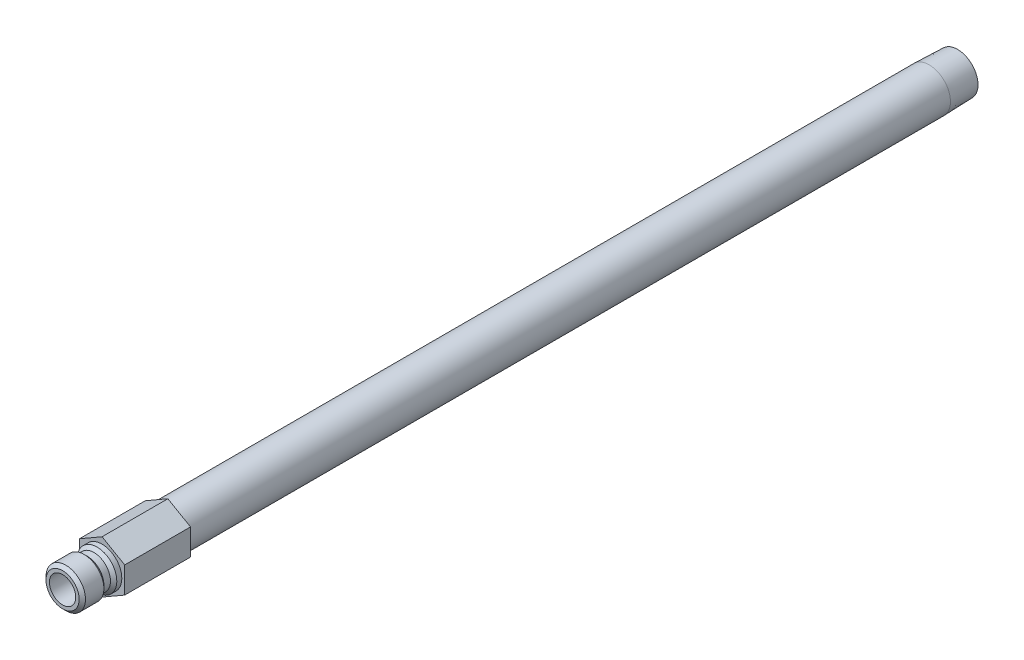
ISO-10303-21;
HEADER;
FILE_DESCRIPTION(('STEP AP214'),'2;1');
FILE_NAME('part.step','',(''),(''),'','','');
FILE_SCHEMA(('AUTOMOTIVE_DESIGN { 1 0 10303 214 1 1 1 1 }'));
ENDSEC;
DATA;
#1=APPLICATION_CONTEXT('core data for automotive mechanical design processes');
#2=APPLICATION_PROTOCOL_DEFINITION('international standard','automotive_design',2000,#1);
#3=PRODUCT_CONTEXT('',#1,'mechanical');
#4=PRODUCT('Part','Part','',(#3));
#5=PRODUCT_RELATED_PRODUCT_CATEGORY('part','',(#4));
#6=PRODUCT_DEFINITION_FORMATION('','',#4);
#7=PRODUCT_DEFINITION_CONTEXT('part definition',#1,'design');
#8=PRODUCT_DEFINITION('design','',#6,#7);
#9=PRODUCT_DEFINITION_SHAPE('','',#8);
#10=(LENGTH_UNIT() NAMED_UNIT(*) SI_UNIT(.MILLI.,.METRE.));
#11=(NAMED_UNIT(*) PLANE_ANGLE_UNIT() SI_UNIT($,.RADIAN.));
#12=(NAMED_UNIT(*) SI_UNIT($,.STERADIAN.) SOLID_ANGLE_UNIT());
#13=UNCERTAINTY_MEASURE_WITH_UNIT(LENGTH_MEASURE(1.E-05),#10,'distance_accuracy_value','');
#14=(GEOMETRIC_REPRESENTATION_CONTEXT(3) GLOBAL_UNCERTAINTY_ASSIGNED_CONTEXT((#13)) GLOBAL_UNIT_ASSIGNED_CONTEXT((#10,
#11,#12)) REPRESENTATION_CONTEXT('',''));
#15=CARTESIAN_POINT('',(0.,0.,0.));
#16=DIRECTION('',(0.,0.,1.));
#17=DIRECTION('',(1.,0.,0.));
#18=AXIS2_PLACEMENT_3D('',#15,#16,#17);
#19=CARTESIAN_POINT('',(0.,4.7625,0.));
#20=DIRECTION('',(0.,0.,1.));
#21=DIRECTION('',(0.,-1.,0.));
#22=AXIS2_PLACEMENT_3D('',#19,#20,#21);
#23=PLANE('',#22);
#24=CARTESIAN_POINT('',(0.,0.,0.));
#25=DIRECTION('',(0.,0.,-1.));
#26=DIRECTION('',(0.,1.,0.));
#27=AXIS2_PLACEMENT_3D('',#24,#25,#26);
#28=CIRCLE('',#27,4.7625);
#29=CARTESIAN_POINT('',(0.,4.7625,0.));
#30=VERTEX_POINT('',#29);
#31=EDGE_CURVE('E165',#30,#30,#28,.T.);
#32=ORIENTED_EDGE('',*,*,#31,.T.);
#33=EDGE_LOOP('',(#32));
#34=FACE_BOUND('',#33,.T.);
#35=DIRECTION('',(-0.866025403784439,-0.5,0.));
#36=VECTOR('',#35,1.);
#37=CARTESIAN_POINT('',(0.,6.3058196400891,0.));
#38=LINE('',#37,#36);
#39=CARTESIAN_POINT('',(0.,6.3058196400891,0.));
#40=VERTEX_POINT('',#39);
#41=CARTESIAN_POINT('',(-5.461,3.15290982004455,0.));
#42=VERTEX_POINT('',#41);
#43=EDGE_CURVE('E121',#40,#42,#38,.T.);
#44=ORIENTED_EDGE('',*,*,#43,.T.);
#45=DIRECTION('',(0.,-1.,0.));
#46=VECTOR('',#45,1.);
#47=CARTESIAN_POINT('',(-5.461,3.15290982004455,0.));
#48=LINE('',#47,#46);
#49=CARTESIAN_POINT('',(-5.461,-3.15290982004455,0.));
#50=VERTEX_POINT('',#49);
#51=EDGE_CURVE('E124',#42,#50,#48,.T.);
#52=ORIENTED_EDGE('',*,*,#51,.T.);
#53=DIRECTION('',(0.866025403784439,-0.5,0.));
#54=VECTOR('',#53,1.);
#55=CARTESIAN_POINT('',(-5.461,-3.15290982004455,0.));
#56=LINE('',#55,#54);
#57=CARTESIAN_POINT('',(0.,-6.30581964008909,0.));
#58=VERTEX_POINT('',#57);
#59=EDGE_CURVE('E128',#50,#58,#56,.T.);
#60=ORIENTED_EDGE('',*,*,#59,.T.);
#61=DIRECTION('',(0.866025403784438,0.5,0.));
#62=VECTOR('',#61,1.);
#63=CARTESIAN_POINT('',(0.,-6.30581964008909,0.));
#64=LINE('',#63,#62);
#65=CARTESIAN_POINT('',(5.461,-3.15290982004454,0.));
#66=VERTEX_POINT('',#65);
#67=EDGE_CURVE('E131',#58,#66,#64,.T.);
#68=ORIENTED_EDGE('',*,*,#67,.T.);
#69=DIRECTION('',(0.,1.,0.));
#70=VECTOR('',#69,1.);
#71=CARTESIAN_POINT('',(5.461,-3.15290982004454,0.));
#72=LINE('',#71,#70);
#73=CARTESIAN_POINT('',(5.461,3.15290982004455,0.));
#74=VERTEX_POINT('',#73);
#75=EDGE_CURVE('E98',#66,#74,#72,.T.);
#76=ORIENTED_EDGE('',*,*,#75,.T.);
#77=DIRECTION('',(-0.866025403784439,0.5,0.));
#78=VECTOR('',#77,1.);
#79=CARTESIAN_POINT('',(5.461,3.15290982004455,0.));
#80=LINE('',#79,#78);
#81=EDGE_CURVE('E134',#74,#40,#80,.T.);
#82=ORIENTED_EDGE('',*,*,#81,.T.);
#83=EDGE_LOOP('',(#44,#52,#60,#68,#76,#82));
#84=FACE_BOUND('',#83,.T.);
#85=ADVANCED_FACE('F32',(#34,#84),#23,.T.);
#86=CARTESIAN_POINT('',(0.,0.,0.));
#87=DIRECTION('',(0.,0.,-1.));
#88=DIRECTION('',(0.,1.,0.));
#89=AXIS2_PLACEMENT_3D('',#86,#87,#88);
#90=CYLINDRICAL_SURFACE('',#89,4.7625);
#91=CARTESIAN_POINT('',(0.,0.,1.2065));
#92=DIRECTION('',(0.,0.,-1.));
#93=DIRECTION('',(0.,1.,0.));
#94=AXIS2_PLACEMENT_3D('',#91,#92,#93);
#95=CIRCLE('',#94,4.7625);
#96=CARTESIAN_POINT('',(0.,4.7625,1.2065));
#97=VERTEX_POINT('',#96);
#98=EDGE_CURVE('E162',#97,#97,#95,.T.);
#99=ORIENTED_EDGE('',*,*,#98,.T.);
#100=EDGE_LOOP('',(#99));
#101=FACE_BOUND('',#100,.T.);
#102=ORIENTED_EDGE('',*,*,#31,.F.);
#103=EDGE_LOOP('',(#102));
#104=FACE_BOUND('',#103,.T.);
#105=ADVANCED_FACE('F191',(#101,#104),#90,.T.);
#106=CARTESIAN_POINT('',(0.,0.,1.2065));
#107=DIRECTION('',(0.,0.,-1.));
#108=DIRECTION('',(0.,1.,0.));
#109=AXIS2_PLACEMENT_3D('',#106,#107,#108);
#110=CONICAL_SURFACE('',#109,4.7625,0.785398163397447);
#111=CARTESIAN_POINT('',(0.,0.,1.9685));
#112=DIRECTION('',(0.,0.,-1.));
#113=DIRECTION('',(0.,1.,0.));
#114=AXIS2_PLACEMENT_3D('',#111,#112,#113);
#115=CIRCLE('',#114,4.0005);
#116=CARTESIAN_POINT('',(0.,4.0005,1.9685));
#117=VERTEX_POINT('',#116);
#118=EDGE_CURVE('E159',#117,#117,#115,.T.);
#119=ORIENTED_EDGE('',*,*,#118,.T.);
#120=EDGE_LOOP('',(#119));
#121=FACE_BOUND('',#120,.T.);
#122=ORIENTED_EDGE('',*,*,#98,.F.);
#123=EDGE_LOOP('',(#122));
#124=FACE_BOUND('',#123,.T.);
#125=ADVANCED_FACE('F197',(#121,#124),#110,.T.);
#126=CARTESIAN_POINT('',(0.,0.,0.));
#127=DIRECTION('',(0.,0.,-1.));
#128=DIRECTION('',(0.,1.,0.));
#129=AXIS2_PLACEMENT_3D('',#126,#127,#128);
#130=CYLINDRICAL_SURFACE('',#129,4.0005);
#131=CARTESIAN_POINT('',(0.,0.,3.556));
#132=DIRECTION('',(0.,0.,-1.));
#133=DIRECTION('',(0.,1.,0.));
#134=AXIS2_PLACEMENT_3D('',#131,#132,#133);
#135=CIRCLE('',#134,4.0005);
#136=CARTESIAN_POINT('',(0.,4.0005,3.556));
#137=VERTEX_POINT('',#136);
#138=EDGE_CURVE('E156',#137,#137,#135,.T.);
#139=ORIENTED_EDGE('',*,*,#138,.T.);
#140=EDGE_LOOP('',(#139));
#141=FACE_BOUND('',#140,.T.);
#142=ORIENTED_EDGE('',*,*,#118,.F.);
#143=EDGE_LOOP('',(#142));
#144=FACE_BOUND('',#143,.T.);
#145=ADVANCED_FACE('F257',(#141,#144),#130,.T.);
#146=CARTESIAN_POINT('',(0.,0.,3.556));
#147=DIRECTION('',(0.,0.,1.));
#148=DIRECTION('',(0.,-1.,0.));
#149=AXIS2_PLACEMENT_3D('',#146,#147,#148);
#150=CONICAL_SURFACE('',#149,4.0005,0.785398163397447);
#151=CARTESIAN_POINT('',(0.,0.,4.318));
#152=DIRECTION('',(0.,0.,-1.));
#153=DIRECTION('',(0.,1.,0.));
#154=AXIS2_PLACEMENT_3D('',#151,#152,#153);
#155=CIRCLE('',#154,4.7625);
#156=CARTESIAN_POINT('',(0.,4.7625,4.318));
#157=VERTEX_POINT('',#156);
#158=EDGE_CURVE('E153',#157,#157,#155,.T.);
#159=ORIENTED_EDGE('',*,*,#158,.T.);
#160=EDGE_LOOP('',(#159));
#161=FACE_BOUND('',#160,.T.);
#162=ORIENTED_EDGE('',*,*,#138,.F.);
#163=EDGE_LOOP('',(#162));
#164=FACE_BOUND('',#163,.T.);
#165=ADVANCED_FACE('F253',(#161,#164),#150,.T.);
#166=CARTESIAN_POINT('',(0.,0.,0.));
#167=DIRECTION('',(0.,0.,-1.));
#168=DIRECTION('',(0.,1.,0.));
#169=AXIS2_PLACEMENT_3D('',#166,#167,#168);
#170=CYLINDRICAL_SURFACE('',#169,4.7625);
#171=CARTESIAN_POINT('',(0.,0.,8.763));
#172=DIRECTION('',(0.,0.,-1.));
#173=DIRECTION('',(0.,1.,0.));
#174=AXIS2_PLACEMENT_3D('',#171,#172,#173);
#175=CIRCLE('',#174,4.7625);
#176=CARTESIAN_POINT('',(0.,4.7625,8.763));
#177=VERTEX_POINT('',#176);
#178=EDGE_CURVE('E150',#177,#177,#175,.T.);
#179=ORIENTED_EDGE('',*,*,#178,.T.);
#180=EDGE_LOOP('',(#179));
#181=FACE_BOUND('',#180,.T.);
#182=ORIENTED_EDGE('',*,*,#158,.F.);
#183=EDGE_LOOP('',(#182));
#184=FACE_BOUND('',#183,.T.);
#185=ADVANCED_FACE('F249',(#181,#184),#170,.T.);
#186=CARTESIAN_POINT('',(0.,0.,8.763));
#187=DIRECTION('',(0.,0.,-1.));
#188=DIRECTION('',(0.,1.,0.));
#189=AXIS2_PLACEMENT_3D('',#186,#187,#188);
#190=CONICAL_SURFACE('',#189,4.7625,0.785398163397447);
#191=CARTESIAN_POINT('',(0.,0.,9.525));
#192=DIRECTION('',(0.,0.,-1.));
#193=DIRECTION('',(0.,1.,0.));
#194=AXIS2_PLACEMENT_3D('',#191,#192,#193);
#195=CIRCLE('',#194,4.0005);
#196=CARTESIAN_POINT('',(0.,4.0005,9.525));
#197=VERTEX_POINT('',#196);
#198=EDGE_CURVE('E147',#197,#197,#195,.T.);
#199=ORIENTED_EDGE('',*,*,#198,.T.);
#200=EDGE_LOOP('',(#199));
#201=FACE_BOUND('',#200,.T.);
#202=ORIENTED_EDGE('',*,*,#178,.F.);
#203=EDGE_LOOP('',(#202));
#204=FACE_BOUND('',#203,.T.);
#205=ADVANCED_FACE('F245',(#201,#204),#190,.T.);
#206=CARTESIAN_POINT('',(0.,3.175,9.525));
#207=DIRECTION('',(0.,0.,1.));
#208=DIRECTION('',(0.,-1.,0.));
#209=AXIS2_PLACEMENT_3D('',#206,#207,#208);
#210=PLANE('',#209);
#211=CARTESIAN_POINT('',(0.,0.,9.525));
#212=DIRECTION('',(0.,0.,-1.));
#213=DIRECTION('',(0.,1.,0.));
#214=AXIS2_PLACEMENT_3D('',#211,#212,#213);
#215=CIRCLE('',#214,3.175);
#216=CARTESIAN_POINT('',(0.,3.175,9.525));
#217=VERTEX_POINT('',#216);
#218=EDGE_CURVE('E144',#217,#217,#215,.T.);
#219=ORIENTED_EDGE('',*,*,#218,.T.);
#220=EDGE_LOOP('',(#219));
#221=FACE_BOUND('',#220,.T.);
#222=ORIENTED_EDGE('',*,*,#198,.F.);
#223=EDGE_LOOP('',(#222));
#224=FACE_BOUND('',#223,.T.);
#225=ADVANCED_FACE('F241',(#221,#224),#210,.T.);
#226=CARTESIAN_POINT('',(0.,0.,0.));
#227=DIRECTION('',(0.,0.,-1.));
#228=DIRECTION('',(0.,1.,0.));
#229=AXIS2_PLACEMENT_3D('',#226,#227,#228);
#230=CYLINDRICAL_SURFACE('',#229,3.175);
#231=CARTESIAN_POINT('',(0.,0.,0.));
#232=DIRECTION('',(0.,0.,1.));
#233=DIRECTION('',(1.,0.,0.));
#234=AXIS2_PLACEMENT_3D('',#231,#232,#233);
#235=CIRCLE('',#234,3.175);
#236=CARTESIAN_POINT('',(3.175,0.,0.));
#237=VERTEX_POINT('',#236);
#238=EDGE_CURVE('E11',#237,#237,#235,.T.);
#239=ORIENTED_EDGE('',*,*,#238,.F.);
#240=EDGE_LOOP('',(#239));
#241=FACE_BOUND('',#240,.T.);
#242=ORIENTED_EDGE('',*,*,#218,.F.);
#243=EDGE_LOOP('',(#242));
#244=FACE_BOUND('',#243,.T.);
#245=ADVANCED_FACE('F225',(#241,#244),#230,.F.);
#246=CARTESIAN_POINT('',(-5.461,3.15290982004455,0.));
#247=DIRECTION('',(0.,0.,1.));
#248=DIRECTION('',(1.,0.,0.));
#249=AXIS2_PLACEMENT_3D('',#246,#247,#248);
#250=PLANE('',#249);
#251=ORIENTED_EDGE('',*,*,#238,.T.);
#252=EDGE_LOOP('',(#251));
#253=FACE_BOUND('',#252,.T.);
#254=CARTESIAN_POINT('',(0.,0.,0.));
#255=DIRECTION('',(0.,0.,1.));
#256=DIRECTION('',(1.,0.,0.));
#257=AXIS2_PLACEMENT_3D('',#254,#255,#256);
#258=CIRCLE('',#257,2.38124999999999);
#259=CARTESIAN_POINT('',(2.38124999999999,0.,0.));
#260=VERTEX_POINT('',#259);
#261=EDGE_CURVE('E125',#260,#260,#258,.T.);
#262=ORIENTED_EDGE('',*,*,#261,.F.);
#263=EDGE_LOOP('',(#262));
#264=FACE_BOUND('',#263,.T.);
#265=ADVANCED_FACE('F221',(#253,#264),#250,.T.);
#266=CARTESIAN_POINT('',(0.,6.3058196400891,-15.875));
#267=DIRECTION('',(-0.5,0.866025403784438,0.));
#268=DIRECTION('',(-0.866025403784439,-0.5,0.));
#269=AXIS2_PLACEMENT_3D('',#266,#267,#268);
#270=PLANE('',#269);
#271=ORIENTED_EDGE('',*,*,#43,.F.);
#272=DIRECTION('',(0.,0.,1.));
#273=VECTOR('',#272,1.);
#274=CARTESIAN_POINT('',(0.,6.3058196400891,-15.875));
#275=LINE('',#274,#273);
#276=CARTESIAN_POINT('',(0.,6.3058196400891,-15.875));
#277=VERTEX_POINT('',#276);
#278=EDGE_CURVE('E50',#277,#40,#275,.T.);
#279=ORIENTED_EDGE('',*,*,#278,.F.);
#280=DIRECTION('',(-0.866025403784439,-0.5,0.));
#281=VECTOR('',#280,1.);
#282=CARTESIAN_POINT('',(0.,6.3058196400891,-15.875));
#283=LINE('',#282,#281);
#284=CARTESIAN_POINT('',(-5.461,3.15290982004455,-15.875));
#285=VERTEX_POINT('',#284);
#286=EDGE_CURVE('E137',#277,#285,#283,.T.);
#287=ORIENTED_EDGE('',*,*,#286,.T.);
#288=DIRECTION('',(0.,0.,1.));
#289=VECTOR('',#288,1.);
#290=CARTESIAN_POINT('',(-5.461,3.15290982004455,-15.875));
#291=LINE('',#290,#289);
#292=EDGE_CURVE('E85',#285,#42,#291,.T.);
#293=ORIENTED_EDGE('',*,*,#292,.T.);
#294=EDGE_LOOP('',(#271,#279,#287,#293));
#295=FACE_BOUND('',#294,.T.);
#296=ADVANCED_FACE('F224',(#295),#270,.T.);
#297=CARTESIAN_POINT('',(5.461,3.15290982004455,-15.875));
#298=DIRECTION('',(0.5,0.866025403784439,0.));
#299=DIRECTION('',(-0.866025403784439,0.5,0.));
#300=AXIS2_PLACEMENT_3D('',#297,#298,#299);
#301=PLANE('',#300);
#302=ORIENTED_EDGE('',*,*,#81,.F.);
#303=DIRECTION('',(0.,0.,1.));
#304=VECTOR('',#303,1.);
#305=CARTESIAN_POINT('',(5.461,3.15290982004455,-15.875));
#306=LINE('',#305,#304);
#307=CARTESIAN_POINT('',(5.461,3.15290982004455,-15.875));
#308=VERTEX_POINT('',#307);
#309=EDGE_CURVE('E73',#308,#74,#306,.T.);
#310=ORIENTED_EDGE('',*,*,#309,.F.);
#311=DIRECTION('',(-0.866025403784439,0.5,0.));
#312=VECTOR('',#311,1.);
#313=CARTESIAN_POINT('',(5.461,3.15290982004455,-15.875));
#314=LINE('',#313,#312);
#315=EDGE_CURVE('E111',#308,#277,#314,.T.);
#316=ORIENTED_EDGE('',*,*,#315,.T.);
#317=ORIENTED_EDGE('',*,*,#278,.T.);
#318=EDGE_LOOP('',(#302,#310,#316,#317));
#319=FACE_BOUND('',#318,.T.);
#320=ADVANCED_FACE('F227',(#319),#301,.T.);
#321=CARTESIAN_POINT('',(5.461,-3.15290982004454,-15.875));
#322=DIRECTION('',(1.,0.,0.));
#323=DIRECTION('',(0.,1.,0.));
#324=AXIS2_PLACEMENT_3D('',#321,#322,#323);
#325=PLANE('',#324);
#326=ORIENTED_EDGE('',*,*,#75,.F.);
#327=DIRECTION('',(0.,0.,1.));
#328=VECTOR('',#327,1.);
#329=CARTESIAN_POINT('',(5.461,-3.15290982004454,-15.875));
#330=LINE('',#329,#328);
#331=CARTESIAN_POINT('',(5.461,-3.15290982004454,-15.875));
#332=VERTEX_POINT('',#331);
#333=EDGE_CURVE('E93',#332,#66,#330,.T.);
#334=ORIENTED_EDGE('',*,*,#333,.F.);
#335=DIRECTION('',(0.,1.,0.));
#336=VECTOR('',#335,1.);
#337=CARTESIAN_POINT('',(5.461,-3.15290982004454,-15.875));
#338=LINE('',#337,#336);
#339=EDGE_CURVE('E96',#332,#308,#338,.T.);
#340=ORIENTED_EDGE('',*,*,#339,.T.);
#341=ORIENTED_EDGE('',*,*,#309,.T.);
#342=EDGE_LOOP('',(#326,#334,#340,#341));
#343=FACE_BOUND('',#342,.T.);
#344=ADVANCED_FACE('F95',(#343),#325,.T.);
#345=CARTESIAN_POINT('',(0.,-6.30581964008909,-15.875));
#346=DIRECTION('',(0.5,-0.866025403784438,0.));
#347=DIRECTION('',(0.866025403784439,0.5,0.));
#348=AXIS2_PLACEMENT_3D('',#345,#346,#347);
#349=PLANE('',#348);
#350=ORIENTED_EDGE('',*,*,#67,.F.);
#351=DIRECTION('',(0.,0.,1.));
#352=VECTOR('',#351,1.);
#353=CARTESIAN_POINT('',(0.,-6.30581964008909,-15.875));
#354=LINE('',#353,#352);
#355=CARTESIAN_POINT('',(0.,-6.30581964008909,-15.875));
#356=VERTEX_POINT('',#355);
#357=EDGE_CURVE('E103',#356,#58,#354,.T.);
#358=ORIENTED_EDGE('',*,*,#357,.F.);
#359=DIRECTION('',(0.866025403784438,0.5,0.));
#360=VECTOR('',#359,1.);
#361=CARTESIAN_POINT('',(0.,-6.30581964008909,-15.875));
#362=LINE('',#361,#360);
#363=EDGE_CURVE('E109',#356,#332,#362,.T.);
#364=ORIENTED_EDGE('',*,*,#363,.T.);
#365=ORIENTED_EDGE('',*,*,#333,.T.);
#366=EDGE_LOOP('',(#350,#358,#364,#365));
#367=FACE_BOUND('',#366,.T.);
#368=ADVANCED_FACE('F113',(#367),#349,.T.);
#369=CARTESIAN_POINT('',(-5.461,-3.15290982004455,-15.875));
#370=DIRECTION('',(-0.5,-0.866025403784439,0.));
#371=DIRECTION('',(0.866025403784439,-0.5,0.));
#372=AXIS2_PLACEMENT_3D('',#369,#370,#371);
#373=PLANE('',#372);
#374=ORIENTED_EDGE('',*,*,#59,.F.);
#375=DIRECTION('',(0.,0.,1.));
#376=VECTOR('',#375,1.);
#377=CARTESIAN_POINT('',(-5.461,-3.15290982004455,-15.875));
#378=LINE('',#377,#376);
#379=CARTESIAN_POINT('',(-5.461,-3.15290982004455,-15.875));
#380=VERTEX_POINT('',#379);
#381=EDGE_CURVE('E141',#380,#50,#378,.T.);
#382=ORIENTED_EDGE('',*,*,#381,.F.);
#383=DIRECTION('',(0.866025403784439,-0.5,0.));
#384=VECTOR('',#383,1.);
#385=CARTESIAN_POINT('',(-5.461,-3.15290982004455,-15.875));
#386=LINE('',#385,#384);
#387=EDGE_CURVE('E114',#380,#356,#386,.T.);
#388=ORIENTED_EDGE('',*,*,#387,.T.);
#389=ORIENTED_EDGE('',*,*,#357,.T.);
#390=EDGE_LOOP('',(#374,#382,#388,#389));
#391=FACE_BOUND('',#390,.T.);
#392=ADVANCED_FACE('F218',(#391),#373,.T.);
#393=CARTESIAN_POINT('',(-5.461,3.15290982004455,-15.875));
#394=DIRECTION('',(-1.,0.,0.));
#395=DIRECTION('',(0.,0.,1.));
#396=AXIS2_PLACEMENT_3D('',#393,#394,#395);
#397=PLANE('',#396);
#398=ORIENTED_EDGE('',*,*,#51,.F.);
#399=ORIENTED_EDGE('',*,*,#292,.F.);
#400=DIRECTION('',(0.,-1.,0.));
#401=VECTOR('',#400,1.);
#402=CARTESIAN_POINT('',(-5.461,3.15290982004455,-15.875));
#403=LINE('',#402,#401);
#404=EDGE_CURVE('E116',#285,#380,#403,.T.);
#405=ORIENTED_EDGE('',*,*,#404,.T.);
#406=ORIENTED_EDGE('',*,*,#381,.T.);
#407=EDGE_LOOP('',(#398,#399,#405,#406));
#408=FACE_BOUND('',#407,.T.);
#409=ADVANCED_FACE('F213',(#408),#397,.T.);
#410=CARTESIAN_POINT('',(-5.461,3.15290982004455,-15.875));
#411=DIRECTION('',(0.,0.,1.));
#412=DIRECTION('',(1.,0.,0.));
#413=AXIS2_PLACEMENT_3D('',#410,#411,#412);
#414=PLANE('',#413);
#415=CARTESIAN_POINT('',(0.,0.,-15.875));
#416=DIRECTION('',(0.,0.,1.));
#417=DIRECTION('',(1.,0.,0.));
#418=AXIS2_PLACEMENT_3D('',#415,#416,#417);
#419=CIRCLE('',#418,5.14349999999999);
#420=CARTESIAN_POINT('',(5.14349999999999,0.,-15.875));
#421=VERTEX_POINT('',#420);
#422=EDGE_CURVE('E36',#421,#421,#419,.F.);
#423=ORIENTED_EDGE('',*,*,#422,.F.);
#424=EDGE_LOOP('',(#423));
#425=FACE_BOUND('',#424,.T.);
#426=ORIENTED_EDGE('',*,*,#286,.F.);
#427=ORIENTED_EDGE('',*,*,#315,.F.);
#428=ORIENTED_EDGE('',*,*,#339,.F.);
#429=ORIENTED_EDGE('',*,*,#363,.F.);
#430=ORIENTED_EDGE('',*,*,#387,.F.);
#431=ORIENTED_EDGE('',*,*,#404,.F.);
#432=EDGE_LOOP('',(#426,#427,#428,#429,#430,#431));
#433=FACE_BOUND('',#432,.T.);
#434=ADVANCED_FACE('F107',(#425,#433),#414,.F.);
#435=CARTESIAN_POINT('',(0.,0.,0.));
#436=DIRECTION('',(0.,0.,-1.));
#437=DIRECTION('',(0.,1.,0.));
#438=AXIS2_PLACEMENT_3D('',#435,#436,#437);
#439=CYLINDRICAL_SURFACE('',#438,2.38124999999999);
#440=CARTESIAN_POINT('',(0.,0.,-206.375));
#441=DIRECTION('',(0.,0.,-1.));
#442=DIRECTION('',(0.,1.,0.));
#443=AXIS2_PLACEMENT_3D('',#440,#441,#442);
#444=CIRCLE('',#443,2.38124999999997);
#445=CARTESIAN_POINT('',(0.,2.38125,-206.375));
#446=VERTEX_POINT('',#445);
#447=EDGE_CURVE('E42',#446,#446,#444,.T.);
#448=ORIENTED_EDGE('',*,*,#447,.T.);
#449=EDGE_LOOP('',(#448));
#450=FACE_BOUND('',#449,.T.);
#451=ORIENTED_EDGE('',*,*,#261,.T.);
#452=EDGE_LOOP('',(#451));
#453=FACE_BOUND('',#452,.T.);
#454=ADVANCED_FACE('F34',(#450,#453),#439,.F.);
#455=CARTESIAN_POINT('',(0.,4.9291887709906,-206.375));
#456=DIRECTION('',(0.,0.,-1.));
#457=DIRECTION('',(0.,1.,0.));
#458=AXIS2_PLACEMENT_3D('',#455,#456,#457);
#459=PLANE('',#458);
#460=CARTESIAN_POINT('',(0.,0.,-206.375));
#461=DIRECTION('',(0.,0.,-1.));
#462=DIRECTION('',(0.,1.,0.));
#463=AXIS2_PLACEMENT_3D('',#460,#461,#462);
#464=CIRCLE('',#463,4.92918877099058);
#465=CARTESIAN_POINT('',(0.,4.9291887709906,-206.375));
#466=VERTEX_POINT('',#465);
#467=EDGE_CURVE('E171',#466,#466,#464,.T.);
#468=ORIENTED_EDGE('',*,*,#467,.T.);
#469=EDGE_LOOP('',(#468));
#470=FACE_BOUND('',#469,.T.);
#471=ORIENTED_EDGE('',*,*,#447,.F.);
#472=EDGE_LOOP('',(#471));
#473=FACE_BOUND('',#472,.T.);
#474=ADVANCED_FACE('F179',(#470,#473),#459,.T.);
#475=CARTESIAN_POINT('',(0.,0.,-206.375));
#476=DIRECTION('',(0.,0.,1.));
#477=DIRECTION('',(0.,-1.,0.));
#478=AXIS2_PLACEMENT_3D('',#475,#476,#477);
#479=CONICAL_SURFACE('',#478,4.92918877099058,0.0312396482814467);
#480=CARTESIAN_POINT('',(0.,0.,-199.517));
#481=DIRECTION('',(0.,0.,-1.));
#482=DIRECTION('',(0.,1.,0.));
#483=AXIS2_PLACEMENT_3D('',#480,#481,#482);
#484=CIRCLE('',#483,5.14349999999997);
#485=CARTESIAN_POINT('',(0.,5.1435,-199.517));
#486=VERTEX_POINT('',#485);
#487=EDGE_CURVE('E168',#486,#486,#484,.T.);
#488=ORIENTED_EDGE('',*,*,#487,.T.);
#489=EDGE_LOOP('',(#488));
#490=FACE_BOUND('',#489,.T.);
#491=ORIENTED_EDGE('',*,*,#467,.F.);
#492=EDGE_LOOP('',(#491));
#493=FACE_BOUND('',#492,.T.);
#494=ADVANCED_FACE('F181',(#490,#493),#479,.T.);
#495=CARTESIAN_POINT('',(0.,0.,0.));
#496=DIRECTION('',(0.,0.,-1.));
#497=DIRECTION('',(0.,1.,0.));
#498=AXIS2_PLACEMENT_3D('',#495,#496,#497);
#499=CYLINDRICAL_SURFACE('',#498,5.14349999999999);
#500=ORIENTED_EDGE('',*,*,#487,.F.);
#501=EDGE_LOOP('',(#500));
#502=FACE_BOUND('',#501,.T.);
#503=ORIENTED_EDGE('',*,*,#422,.T.);
#504=EDGE_LOOP('',(#503));
#505=FACE_BOUND('',#504,.T.);
#506=ADVANCED_FACE('F187',(#502,#505),#499,.T.);
#507=CLOSED_SHELL('',(#85,#105,#125,#145,#165,#185,#205,#225,#245,#265,#296,#320,#344,#368,#392,
#409,#434,#454,#474,#494,#506));
#508=MANIFOLD_SOLID_BREP('B2',#507);
#509=ADVANCED_BREP_SHAPE_REPRESENTATION('',(#18,#508),#14);
#510=SHAPE_DEFINITION_REPRESENTATION(#9,#509);
ENDSEC;
END-ISO-10303-21;
